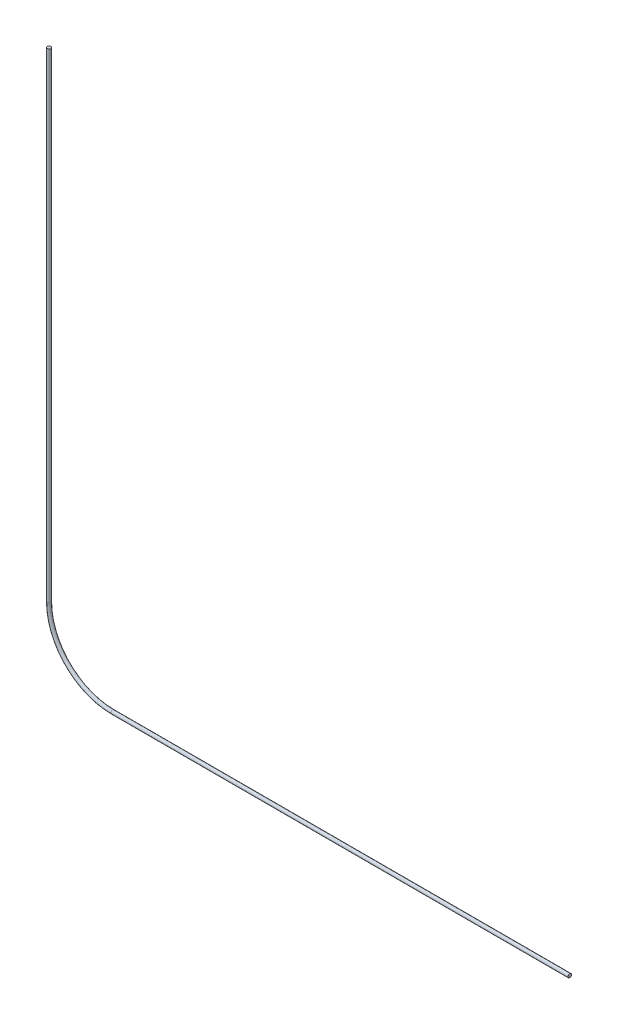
from build123d import *

# Parameters (mm, degrees)
SKETCH2_R = 0.18


with BuildPart() as part:
    # Sweep1: sweep along a path in Sketch1
    with BuildLine(Plane.XY) as sweep1_path:
        Line((0, 0), (-45.7, 0))
        ThreePointArc((-45.7, 0), (-50.198966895, 1.863533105), (-52.0625, 6.3625))
        Line((-52.0625, 6.3625), (-52.0625, 54.350291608))
    # Sketch2 → Sweep1 (sweep)
    with BuildSketch(Plane(origin=(0, 0, 0), x_dir=(0, 0, -1), z_dir=(1, 0, 0))):
        Circle(SKETCH2_R)
    sweep(path=sweep1_path.line)


solid = part.part
